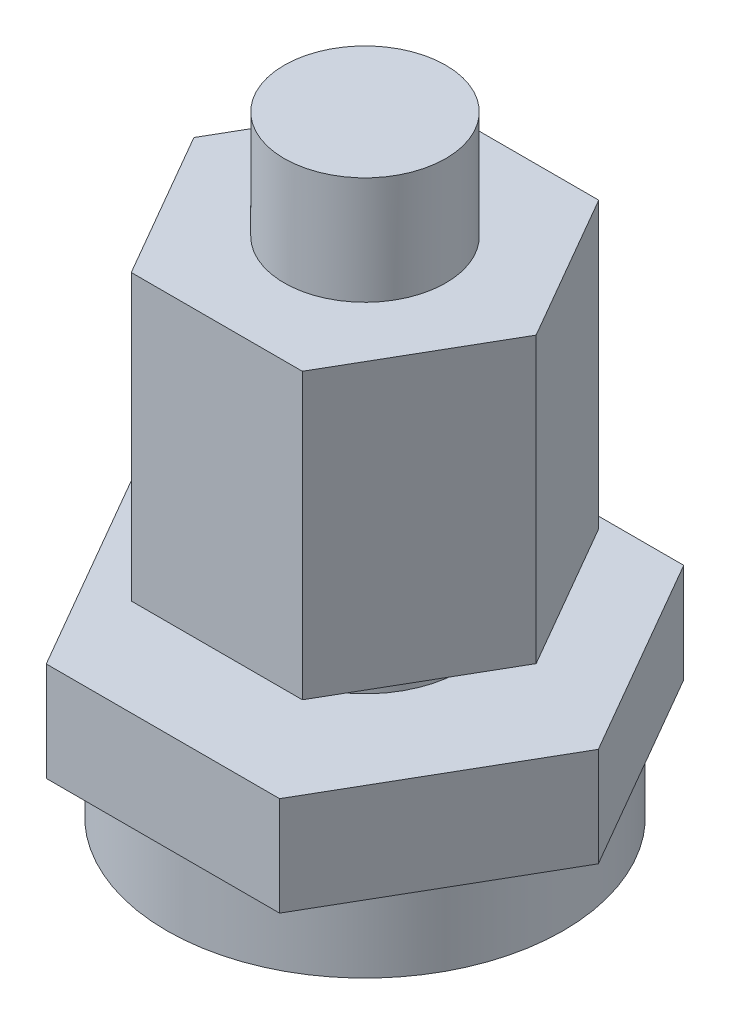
ISO-10303-21;
HEADER;
FILE_DESCRIPTION(('STEP AP214'),'2;1');
FILE_NAME('part.step','',(''),(''),'','','');
FILE_SCHEMA(('AUTOMOTIVE_DESIGN { 1 0 10303 214 1 1 1 1 }'));
ENDSEC;
DATA;
#1=APPLICATION_CONTEXT('core data for automotive mechanical design processes');
#2=APPLICATION_PROTOCOL_DEFINITION('international standard','automotive_design',2000,#1);
#3=PRODUCT_CONTEXT('',#1,'mechanical');
#4=PRODUCT('Part','Part','',(#3));
#5=PRODUCT_RELATED_PRODUCT_CATEGORY('part','',(#4));
#6=PRODUCT_DEFINITION_FORMATION('','',#4);
#7=PRODUCT_DEFINITION_CONTEXT('part definition',#1,'design');
#8=PRODUCT_DEFINITION('design','',#6,#7);
#9=PRODUCT_DEFINITION_SHAPE('','',#8);
#10=(LENGTH_UNIT() NAMED_UNIT(*) SI_UNIT(.MILLI.,.METRE.));
#11=(NAMED_UNIT(*) PLANE_ANGLE_UNIT() SI_UNIT($,.RADIAN.));
#12=(NAMED_UNIT(*) SI_UNIT($,.STERADIAN.) SOLID_ANGLE_UNIT());
#13=UNCERTAINTY_MEASURE_WITH_UNIT(LENGTH_MEASURE(1.E-05),#10,'distance_accuracy_value','');
#14=(GEOMETRIC_REPRESENTATION_CONTEXT(3) GLOBAL_UNCERTAINTY_ASSIGNED_CONTEXT((#13)) GLOBAL_UNIT_ASSIGNED_CONTEXT((#10,
#11,#12)) REPRESENTATION_CONTEXT('',''));
#15=CARTESIAN_POINT('',(0.,0.,0.));
#16=DIRECTION('',(0.,0.,1.));
#17=DIRECTION('',(1.,0.,0.));
#18=AXIS2_PLACEMENT_3D('',#15,#16,#17);
#19=CARTESIAN_POINT('',(-10.0819790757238,29.591,0.));
#20=DIRECTION('',(0.,-1.,0.));
#21=DIRECTION('',(0.,0.,-1.));
#22=AXIS2_PLACEMENT_3D('',#19,#20,#21);
#23=PLANE('',#22);
#24=DIRECTION('',(0.5,0.,0.866025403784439));
#25=VECTOR('',#24,1.);
#26=CARTESIAN_POINT('',(-10.0819790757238,29.591,0.));
#27=LINE('',#26,#25);
#28=CARTESIAN_POINT('',(-10.0819790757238,29.591,0.));
#29=VERTEX_POINT('',#28);
#30=CARTESIAN_POINT('',(-5.04098953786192,29.591,8.73125));
#31=VERTEX_POINT('',#30);
#32=EDGE_CURVE('E257',#29,#31,#27,.T.);
#33=ORIENTED_EDGE('',*,*,#32,.T.);
#34=DIRECTION('',(1.,0.,0.));
#35=VECTOR('',#34,1.);
#36=CARTESIAN_POINT('',(-5.04098953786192,29.591,8.73125));
#37=LINE('',#36,#35);
#38=CARTESIAN_POINT('',(5.04098953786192,29.591,8.73125));
#39=VERTEX_POINT('',#38);
#40=EDGE_CURVE('E285',#31,#39,#37,.T.);
#41=ORIENTED_EDGE('',*,*,#40,.T.);
#42=DIRECTION('',(0.5,0.,-0.866025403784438));
#43=VECTOR('',#42,1.);
#44=CARTESIAN_POINT('',(5.04098953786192,29.591,8.73125));
#45=LINE('',#44,#43);
#46=CARTESIAN_POINT('',(10.0819790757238,29.591,0.));
#47=VERTEX_POINT('',#46);
#48=EDGE_CURVE('E282',#39,#47,#45,.T.);
#49=ORIENTED_EDGE('',*,*,#48,.T.);
#50=DIRECTION('',(-0.500000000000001,0.,-0.866025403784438));
#51=VECTOR('',#50,1.);
#52=CARTESIAN_POINT('',(10.0819790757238,29.591,0.));
#53=LINE('',#52,#51);
#54=CARTESIAN_POINT('',(5.04098953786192,29.591,-8.73125));
#55=VERTEX_POINT('',#54);
#56=EDGE_CURVE('E279',#47,#55,#53,.T.);
#57=ORIENTED_EDGE('',*,*,#56,.T.);
#58=DIRECTION('',(-1.,0.,0.));
#59=VECTOR('',#58,1.);
#60=CARTESIAN_POINT('',(5.04098953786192,29.591,-8.73125));
#61=LINE('',#60,#59);
#62=CARTESIAN_POINT('',(-5.04098953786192,29.591,-8.73125));
#63=VERTEX_POINT('',#62);
#64=EDGE_CURVE('E276',#55,#63,#61,.T.);
#65=ORIENTED_EDGE('',*,*,#64,.T.);
#66=DIRECTION('',(-0.5,0.,0.866025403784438));
#67=VECTOR('',#66,1.);
#68=CARTESIAN_POINT('',(-5.04098953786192,29.591,-8.73125));
#69=LINE('',#68,#67);
#70=EDGE_CURVE('E253',#63,#29,#69,.T.);
#71=ORIENTED_EDGE('',*,*,#70,.T.);
#72=EDGE_LOOP('',(#33,#41,#49,#57,#65,#71));
#73=FACE_BOUND('',#72,.T.);
#74=CARTESIAN_POINT('',(0.,29.591,0.));
#75=DIRECTION('',(0.,-1.,0.));
#76=DIRECTION('',(0.,0.,-1.));
#77=AXIS2_PLACEMENT_3D('',#74,#75,#76);
#78=CIRCLE('',#77,4.7625);
#79=CARTESIAN_POINT('',(0.,29.591,-4.7625));
#80=VERTEX_POINT('',#79);
#81=EDGE_CURVE('E11',#80,#80,#78,.F.);
#82=ORIENTED_EDGE('',*,*,#81,.F.);
#83=EDGE_LOOP('',(#82));
#84=FACE_BOUND('',#83,.T.);
#85=ADVANCED_FACE('F31',(#73,#84),#23,.F.);
#86=CARTESIAN_POINT('',(-6.87407664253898,10.287,11.90625));
#87=DIRECTION('',(0.,1.,0.));
#88=DIRECTION('',(0.,0.,1.));
#89=AXIS2_PLACEMENT_3D('',#86,#87,#88);
#90=PLANE('',#89);
#91=DIRECTION('',(0.5,0.,0.866025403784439));
#92=VECTOR('',#91,1.);
#93=CARTESIAN_POINT('',(-13.748153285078,10.287,0.));
#94=LINE('',#93,#92);
#95=CARTESIAN_POINT('',(-13.748153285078,10.287,0.));
#96=VERTEX_POINT('',#95);
#97=CARTESIAN_POINT('',(-6.87407664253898,10.287,11.90625));
#98=VERTEX_POINT('',#97);
#99=EDGE_CURVE('E133',#96,#98,#94,.T.);
#100=ORIENTED_EDGE('',*,*,#99,.T.);
#101=DIRECTION('',(1.,0.,0.));
#102=VECTOR('',#101,1.);
#103=CARTESIAN_POINT('',(-6.87407664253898,10.287,11.90625));
#104=LINE('',#103,#102);
#105=CARTESIAN_POINT('',(6.87407664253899,10.287,11.90625));
#106=VERTEX_POINT('',#105);
#107=EDGE_CURVE('E87',#98,#106,#104,.T.);
#108=ORIENTED_EDGE('',*,*,#107,.T.);
#109=DIRECTION('',(0.5,0.,-0.866025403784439));
#110=VECTOR('',#109,1.);
#111=CARTESIAN_POINT('',(6.87407664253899,10.287,11.90625));
#112=LINE('',#111,#110);
#113=CARTESIAN_POINT('',(13.748153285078,10.287,0.));
#114=VERTEX_POINT('',#113);
#115=EDGE_CURVE('E104',#106,#114,#112,.T.);
#116=ORIENTED_EDGE('',*,*,#115,.T.);
#117=DIRECTION('',(-0.5,0.,-0.866025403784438));
#118=VECTOR('',#117,1.);
#119=CARTESIAN_POINT('',(13.748153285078,10.287,0.));
#120=LINE('',#119,#118);
#121=CARTESIAN_POINT('',(6.87407664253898,10.287,-11.90625));
#122=VERTEX_POINT('',#121);
#123=EDGE_CURVE('E97',#114,#122,#120,.T.);
#124=ORIENTED_EDGE('',*,*,#123,.T.);
#125=DIRECTION('',(-1.,0.,0.));
#126=VECTOR('',#125,1.);
#127=CARTESIAN_POINT('',(6.87407664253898,10.287,-11.90625));
#128=LINE('',#127,#126);
#129=CARTESIAN_POINT('',(-6.87407664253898,10.287,-11.90625));
#130=VERTEX_POINT('',#129);
#131=EDGE_CURVE('E102',#122,#130,#128,.T.);
#132=ORIENTED_EDGE('',*,*,#131,.T.);
#133=DIRECTION('',(-0.5,0.,0.866025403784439));
#134=VECTOR('',#133,1.);
#135=CARTESIAN_POINT('',(-6.87407664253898,10.287,-11.90625));
#136=LINE('',#135,#134);
#137=EDGE_CURVE('E48',#130,#96,#136,.T.);
#138=ORIENTED_EDGE('',*,*,#137,.T.);
#139=EDGE_LOOP('',(#100,#108,#116,#124,#132,#138));
#140=FACE_BOUND('',#139,.T.);
#141=CARTESIAN_POINT('',(0.,10.287,0.));
#142=DIRECTION('',(0.,1.,0.));
#143=DIRECTION('',(0.,0.,1.));
#144=AXIS2_PLACEMENT_3D('',#141,#142,#143);
#145=CIRCLE('',#144,5.715);
#146=CARTESIAN_POINT('',(0.,10.287,5.715));
#147=VERTEX_POINT('',#146);
#148=EDGE_CURVE('E230',#147,#147,#145,.T.);
#149=ORIENTED_EDGE('',*,*,#148,.F.);
#150=EDGE_LOOP('',(#149));
#151=FACE_BOUND('',#150,.T.);
#152=ADVANCED_FACE('F99',(#140,#151),#90,.T.);
#153=CARTESIAN_POINT('',(0.,4.445,0.));
#154=DIRECTION('',(0.,-1.,0.));
#155=DIRECTION('',(0.,0.,-1.));
#156=AXIS2_PLACEMENT_3D('',#153,#154,#155);
#157=CYLINDRICAL_SURFACE('',#156,11.684);
#158=CARTESIAN_POINT('',(0.,4.445,0.));
#159=DIRECTION('',(0.,1.,0.));
#160=DIRECTION('',(0.,0.,1.));
#161=AXIS2_PLACEMENT_3D('',#158,#159,#160);
#162=CIRCLE('',#161,11.684);
#163=CARTESIAN_POINT('',(0.,4.445,11.684));
#164=VERTEX_POINT('',#163);
#165=EDGE_CURVE('E40',#164,#164,#162,.T.);
#166=ORIENTED_EDGE('',*,*,#165,.F.);
#167=EDGE_LOOP('',(#166));
#168=FACE_BOUND('',#167,.T.);
#169=CARTESIAN_POINT('',(0.,0.,0.));
#170=DIRECTION('',(0.,1.,0.));
#171=DIRECTION('',(0.,0.,1.));
#172=AXIS2_PLACEMENT_3D('',#169,#170,#171);
#173=CIRCLE('',#172,11.684);
#174=CARTESIAN_POINT('',(0.,0.,11.684));
#175=VERTEX_POINT('',#174);
#176=EDGE_CURVE('E142',#175,#175,#173,.T.);
#177=ORIENTED_EDGE('',*,*,#176,.T.);
#178=EDGE_LOOP('',(#177));
#179=FACE_BOUND('',#178,.T.);
#180=ADVANCED_FACE('F33',(#168,#179),#157,.T.);
#181=CARTESIAN_POINT('',(0.,0.,0.));
#182=DIRECTION('',(0.,1.,0.));
#183=DIRECTION('',(0.,0.,1.));
#184=AXIS2_PLACEMENT_3D('',#181,#182,#183);
#185=PLANE('',#184);
#186=ORIENTED_EDGE('',*,*,#176,.F.);
#187=EDGE_LOOP('',(#186));
#188=FACE_BOUND('',#187,.T.);
#189=ADVANCED_FACE('F148',(#188),#185,.F.);
#190=CARTESIAN_POINT('',(-6.87407664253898,4.445,11.90625));
#191=DIRECTION('',(0.,1.,0.));
#192=DIRECTION('',(0.,0.,1.));
#193=AXIS2_PLACEMENT_3D('',#190,#191,#192);
#194=PLANE('',#193);
#195=DIRECTION('',(0.5,0.,0.866025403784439));
#196=VECTOR('',#195,1.);
#197=CARTESIAN_POINT('',(-13.748153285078,4.445,0.));
#198=LINE('',#197,#196);
#199=CARTESIAN_POINT('',(-13.748153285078,4.445,0.));
#200=VERTEX_POINT('',#199);
#201=CARTESIAN_POINT('',(-6.87407664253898,4.445,11.90625));
#202=VERTEX_POINT('',#201);
#203=EDGE_CURVE('E122',#200,#202,#198,.T.);
#204=ORIENTED_EDGE('',*,*,#203,.F.);
#205=DIRECTION('',(-0.5,0.,0.866025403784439));
#206=VECTOR('',#205,1.);
#207=CARTESIAN_POINT('',(-6.87407664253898,4.445,-11.90625));
#208=LINE('',#207,#206);
#209=CARTESIAN_POINT('',(-6.87407664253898,4.445,-11.90625));
#210=VERTEX_POINT('',#209);
#211=EDGE_CURVE('E78',#210,#200,#208,.T.);
#212=ORIENTED_EDGE('',*,*,#211,.F.);
#213=DIRECTION('',(-1.,0.,0.));
#214=VECTOR('',#213,1.);
#215=CARTESIAN_POINT('',(6.87407664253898,4.445,-11.90625));
#216=LINE('',#215,#214);
#217=CARTESIAN_POINT('',(6.87407664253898,4.445,-11.90625));
#218=VERTEX_POINT('',#217);
#219=EDGE_CURVE('E72',#218,#210,#216,.T.);
#220=ORIENTED_EDGE('',*,*,#219,.F.);
#221=DIRECTION('',(-0.5,0.,-0.866025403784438));
#222=VECTOR('',#221,1.);
#223=CARTESIAN_POINT('',(13.748153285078,4.445,0.));
#224=LINE('',#223,#222);
#225=CARTESIAN_POINT('',(13.748153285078,4.445,0.));
#226=VERTEX_POINT('',#225);
#227=EDGE_CURVE('E112',#226,#218,#224,.T.);
#228=ORIENTED_EDGE('',*,*,#227,.F.);
#229=DIRECTION('',(0.5,0.,-0.866025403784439));
#230=VECTOR('',#229,1.);
#231=CARTESIAN_POINT('',(6.87407664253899,4.445,11.90625));
#232=LINE('',#231,#230);
#233=CARTESIAN_POINT('',(6.87407664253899,4.445,11.90625));
#234=VERTEX_POINT('',#233);
#235=EDGE_CURVE('E128',#234,#226,#232,.T.);
#236=ORIENTED_EDGE('',*,*,#235,.F.);
#237=DIRECTION('',(1.,0.,0.));
#238=VECTOR('',#237,1.);
#239=CARTESIAN_POINT('',(-6.87407664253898,4.445,11.90625));
#240=LINE('',#239,#238);
#241=EDGE_CURVE('E125',#202,#234,#240,.T.);
#242=ORIENTED_EDGE('',*,*,#241,.F.);
#243=EDGE_LOOP('',(#204,#212,#220,#228,#236,#242));
#244=FACE_BOUND('',#243,.T.);
#245=ORIENTED_EDGE('',*,*,#165,.T.);
#246=EDGE_LOOP('',(#245));
#247=FACE_BOUND('',#246,.T.);
#248=ADVANCED_FACE('F150',(#244,#247),#194,.F.);
#249=CARTESIAN_POINT('',(-13.748153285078,10.287,0.));
#250=DIRECTION('',(0.866025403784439,0.,-0.5));
#251=DIRECTION('',(-0.5,0.,-0.866025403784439));
#252=AXIS2_PLACEMENT_3D('',#249,#250,#251);
#253=PLANE('',#252);
#254=ORIENTED_EDGE('',*,*,#203,.T.);
#255=DIRECTION('',(0.,-1.,0.));
#256=VECTOR('',#255,1.);
#257=CARTESIAN_POINT('',(-6.87407664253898,10.287,11.90625));
#258=LINE('',#257,#256);
#259=EDGE_CURVE('E140',#98,#202,#258,.T.);
#260=ORIENTED_EDGE('',*,*,#259,.F.);
#261=ORIENTED_EDGE('',*,*,#99,.F.);
#262=DIRECTION('',(0.,-1.,0.));
#263=VECTOR('',#262,1.);
#264=CARTESIAN_POINT('',(-13.748153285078,10.287,0.));
#265=LINE('',#264,#263);
#266=EDGE_CURVE('E118',#96,#200,#265,.T.);
#267=ORIENTED_EDGE('',*,*,#266,.T.);
#268=EDGE_LOOP('',(#254,#260,#261,#267));
#269=FACE_BOUND('',#268,.T.);
#270=ADVANCED_FACE('F155',(#269),#253,.F.);
#271=CARTESIAN_POINT('',(-6.87407664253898,10.287,11.90625));
#272=DIRECTION('',(0.,0.,-1.));
#273=DIRECTION('',(-1.,0.,0.));
#274=AXIS2_PLACEMENT_3D('',#271,#272,#273);
#275=PLANE('',#274);
#276=ORIENTED_EDGE('',*,*,#241,.T.);
#277=DIRECTION('',(0.,-1.,0.));
#278=VECTOR('',#277,1.);
#279=CARTESIAN_POINT('',(6.87407664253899,10.287,11.90625));
#280=LINE('',#279,#278);
#281=EDGE_CURVE('E137',#106,#234,#280,.T.);
#282=ORIENTED_EDGE('',*,*,#281,.F.);
#283=ORIENTED_EDGE('',*,*,#107,.F.);
#284=ORIENTED_EDGE('',*,*,#259,.T.);
#285=EDGE_LOOP('',(#276,#282,#283,#284));
#286=FACE_BOUND('',#285,.T.);
#287=ADVANCED_FACE('F215',(#286),#275,.F.);
#288=CARTESIAN_POINT('',(6.87407664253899,10.287,11.90625));
#289=DIRECTION('',(-0.866025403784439,0.,-0.5));
#290=DIRECTION('',(-0.5,0.,0.866025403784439));
#291=AXIS2_PLACEMENT_3D('',#288,#289,#290);
#292=PLANE('',#291);
#293=ORIENTED_EDGE('',*,*,#235,.T.);
#294=DIRECTION('',(0.,-1.,0.));
#295=VECTOR('',#294,1.);
#296=CARTESIAN_POINT('',(13.748153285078,10.287,0.));
#297=LINE('',#296,#295);
#298=EDGE_CURVE('E113',#114,#226,#297,.T.);
#299=ORIENTED_EDGE('',*,*,#298,.F.);
#300=ORIENTED_EDGE('',*,*,#115,.F.);
#301=ORIENTED_EDGE('',*,*,#281,.T.);
#302=EDGE_LOOP('',(#293,#299,#300,#301));
#303=FACE_BOUND('',#302,.T.);
#304=ADVANCED_FACE('F212',(#303),#292,.F.);
#305=CARTESIAN_POINT('',(13.748153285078,10.287,0.));
#306=DIRECTION('',(-0.866025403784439,0.,0.5));
#307=DIRECTION('',(0.5,0.,0.866025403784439));
#308=AXIS2_PLACEMENT_3D('',#305,#306,#307);
#309=PLANE('',#308);
#310=ORIENTED_EDGE('',*,*,#227,.T.);
#311=DIRECTION('',(0.,-1.,0.));
#312=VECTOR('',#311,1.);
#313=CARTESIAN_POINT('',(6.87407664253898,10.287,-11.90625));
#314=LINE('',#313,#312);
#315=EDGE_CURVE('E109',#122,#218,#314,.T.);
#316=ORIENTED_EDGE('',*,*,#315,.F.);
#317=ORIENTED_EDGE('',*,*,#123,.F.);
#318=ORIENTED_EDGE('',*,*,#298,.T.);
#319=EDGE_LOOP('',(#310,#316,#317,#318));
#320=FACE_BOUND('',#319,.T.);
#321=ADVANCED_FACE('F110',(#320),#309,.F.);
#322=CARTESIAN_POINT('',(6.87407664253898,10.287,-11.90625));
#323=DIRECTION('',(0.,0.,1.));
#324=DIRECTION('',(1.,0.,0.));
#325=AXIS2_PLACEMENT_3D('',#322,#323,#324);
#326=PLANE('',#325);
#327=ORIENTED_EDGE('',*,*,#219,.T.);
#328=DIRECTION('',(0.,-1.,0.));
#329=VECTOR('',#328,1.);
#330=CARTESIAN_POINT('',(-6.87407664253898,10.287,-11.90625));
#331=LINE('',#330,#329);
#332=EDGE_CURVE('E114',#130,#210,#331,.T.);
#333=ORIENTED_EDGE('',*,*,#332,.F.);
#334=ORIENTED_EDGE('',*,*,#131,.F.);
#335=ORIENTED_EDGE('',*,*,#315,.T.);
#336=EDGE_LOOP('',(#327,#333,#334,#335));
#337=FACE_BOUND('',#336,.T.);
#338=ADVANCED_FACE('F116',(#337),#326,.F.);
#339=CARTESIAN_POINT('',(-6.87407664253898,10.287,-11.90625));
#340=DIRECTION('',(0.866025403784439,0.,0.5));
#341=DIRECTION('',(0.5,0.,-0.866025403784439));
#342=AXIS2_PLACEMENT_3D('',#339,#340,#341);
#343=PLANE('',#342);
#344=ORIENTED_EDGE('',*,*,#211,.T.);
#345=ORIENTED_EDGE('',*,*,#266,.F.);
#346=ORIENTED_EDGE('',*,*,#137,.F.);
#347=ORIENTED_EDGE('',*,*,#332,.T.);
#348=EDGE_LOOP('',(#344,#345,#346,#347));
#349=FACE_BOUND('',#348,.T.);
#350=ADVANCED_FACE('F203',(#349),#343,.F.);
#351=CARTESIAN_POINT('',(0.,12.827,0.));
#352=DIRECTION('',(0.,-1.,0.));
#353=DIRECTION('',(0.,0.,-1.));
#354=AXIS2_PLACEMENT_3D('',#351,#352,#353);
#355=CYLINDRICAL_SURFACE('',#354,5.715);
#356=CARTESIAN_POINT('',(0.,12.827,0.));
#357=DIRECTION('',(0.,1.,0.));
#358=DIRECTION('',(0.,0.,1.));
#359=AXIS2_PLACEMENT_3D('',#356,#357,#358);
#360=CIRCLE('',#359,5.715);
#361=CARTESIAN_POINT('',(0.,12.827,5.715));
#362=VERTEX_POINT('',#361);
#363=EDGE_CURVE('E126',#362,#362,#360,.T.);
#364=ORIENTED_EDGE('',*,*,#363,.F.);
#365=EDGE_LOOP('',(#364));
#366=FACE_BOUND('',#365,.T.);
#367=ORIENTED_EDGE('',*,*,#148,.T.);
#368=EDGE_LOOP('',(#367));
#369=FACE_BOUND('',#368,.T.);
#370=ADVANCED_FACE('F177',(#366,#369),#355,.T.);
#371=CARTESIAN_POINT('',(-10.0819790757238,12.827,0.));
#372=DIRECTION('',(0.,-1.,0.));
#373=DIRECTION('',(0.,0.,-1.));
#374=AXIS2_PLACEMENT_3D('',#371,#372,#373);
#375=PLANE('',#374);
#376=DIRECTION('',(0.5,0.,0.866025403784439));
#377=VECTOR('',#376,1.);
#378=CARTESIAN_POINT('',(-10.0819790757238,12.827,0.));
#379=LINE('',#378,#377);
#380=CARTESIAN_POINT('',(-10.0819790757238,12.827,0.));
#381=VERTEX_POINT('',#380);
#382=CARTESIAN_POINT('',(-5.04098953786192,12.827,8.73125));
#383=VERTEX_POINT('',#382);
#384=EDGE_CURVE('E270',#381,#383,#379,.T.);
#385=ORIENTED_EDGE('',*,*,#384,.F.);
#386=DIRECTION('',(-0.5,0.,0.866025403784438));
#387=VECTOR('',#386,1.);
#388=CARTESIAN_POINT('',(-5.04098953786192,12.827,-8.73125));
#389=LINE('',#388,#387);
#390=CARTESIAN_POINT('',(-5.04098953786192,12.827,-8.73125));
#391=VERTEX_POINT('',#390);
#392=EDGE_CURVE('E254',#391,#381,#389,.T.);
#393=ORIENTED_EDGE('',*,*,#392,.F.);
#394=DIRECTION('',(-1.,0.,0.));
#395=VECTOR('',#394,1.);
#396=CARTESIAN_POINT('',(5.04098953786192,12.827,-8.73125));
#397=LINE('',#396,#395);
#398=CARTESIAN_POINT('',(5.04098953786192,12.827,-8.73125));
#399=VERTEX_POINT('',#398);
#400=EDGE_CURVE('E258',#399,#391,#397,.T.);
#401=ORIENTED_EDGE('',*,*,#400,.F.);
#402=DIRECTION('',(-0.500000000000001,0.,-0.866025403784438));
#403=VECTOR('',#402,1.);
#404=CARTESIAN_POINT('',(10.0819790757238,12.827,0.));
#405=LINE('',#404,#403);
#406=CARTESIAN_POINT('',(10.0819790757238,12.827,0.));
#407=VERTEX_POINT('',#406);
#408=EDGE_CURVE('E261',#407,#399,#405,.T.);
#409=ORIENTED_EDGE('',*,*,#408,.F.);
#410=DIRECTION('',(0.5,0.,-0.866025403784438));
#411=VECTOR('',#410,1.);
#412=CARTESIAN_POINT('',(5.04098953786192,12.827,8.73125));
#413=LINE('',#412,#411);
#414=CARTESIAN_POINT('',(5.04098953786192,12.827,8.73125));
#415=VERTEX_POINT('',#414);
#416=EDGE_CURVE('E264',#415,#407,#413,.T.);
#417=ORIENTED_EDGE('',*,*,#416,.F.);
#418=DIRECTION('',(1.,0.,0.));
#419=VECTOR('',#418,1.);
#420=CARTESIAN_POINT('',(-5.04098953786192,12.827,8.73125));
#421=LINE('',#420,#419);
#422=EDGE_CURVE('E267',#383,#415,#421,.T.);
#423=ORIENTED_EDGE('',*,*,#422,.F.);
#424=EDGE_LOOP('',(#385,#393,#401,#409,#417,#423));
#425=FACE_BOUND('',#424,.T.);
#426=ORIENTED_EDGE('',*,*,#363,.T.);
#427=EDGE_LOOP('',(#426));
#428=FACE_BOUND('',#427,.T.);
#429=ADVANCED_FACE('F173',(#425,#428),#375,.T.);
#430=CARTESIAN_POINT('',(-10.0819790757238,29.591,0.));
#431=DIRECTION('',(0.866025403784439,0.,-0.5));
#432=DIRECTION('',(-0.5,0.,-0.866025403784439));
#433=AXIS2_PLACEMENT_3D('',#430,#431,#432);
#434=PLANE('',#433);
#435=ORIENTED_EDGE('',*,*,#384,.T.);
#436=DIRECTION('',(0.,-1.,0.));
#437=VECTOR('',#436,1.);
#438=CARTESIAN_POINT('',(-5.04098953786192,29.591,8.73125));
#439=LINE('',#438,#437);
#440=EDGE_CURVE('E233',#31,#383,#439,.T.);
#441=ORIENTED_EDGE('',*,*,#440,.F.);
#442=ORIENTED_EDGE('',*,*,#32,.F.);
#443=DIRECTION('',(0.,-1.,0.));
#444=VECTOR('',#443,1.);
#445=CARTESIAN_POINT('',(-10.0819790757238,29.591,0.));
#446=LINE('',#445,#444);
#447=EDGE_CURVE('E250',#29,#381,#446,.T.);
#448=ORIENTED_EDGE('',*,*,#447,.T.);
#449=EDGE_LOOP('',(#435,#441,#442,#448));
#450=FACE_BOUND('',#449,.T.);
#451=ADVANCED_FACE('F176',(#450),#434,.F.);
#452=CARTESIAN_POINT('',(-5.04098953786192,29.591,8.73125));
#453=DIRECTION('',(0.,0.,-1.));
#454=DIRECTION('',(-1.,0.,0.));
#455=AXIS2_PLACEMENT_3D('',#452,#453,#454);
#456=PLANE('',#455);
#457=ORIENTED_EDGE('',*,*,#422,.T.);
#458=DIRECTION('',(0.,-1.,0.));
#459=VECTOR('',#458,1.);
#460=CARTESIAN_POINT('',(5.04098953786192,29.591,8.73125));
#461=LINE('',#460,#459);
#462=EDGE_CURVE('E238',#39,#415,#461,.T.);
#463=ORIENTED_EDGE('',*,*,#462,.F.);
#464=ORIENTED_EDGE('',*,*,#40,.F.);
#465=ORIENTED_EDGE('',*,*,#440,.T.);
#466=EDGE_LOOP('',(#457,#463,#464,#465));
#467=FACE_BOUND('',#466,.T.);
#468=ADVANCED_FACE('F194',(#467),#456,.F.);
#469=CARTESIAN_POINT('',(5.04098953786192,29.591,8.73125));
#470=DIRECTION('',(-0.866025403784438,0.,-0.5));
#471=DIRECTION('',(-0.5,0.,0.866025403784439));
#472=AXIS2_PLACEMENT_3D('',#469,#470,#471);
#473=PLANE('',#472);
#474=ORIENTED_EDGE('',*,*,#416,.T.);
#475=DIRECTION('',(0.,-1.,0.));
#476=VECTOR('',#475,1.);
#477=CARTESIAN_POINT('',(10.0819790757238,29.591,0.));
#478=LINE('',#477,#476);
#479=EDGE_CURVE('E241',#47,#407,#478,.T.);
#480=ORIENTED_EDGE('',*,*,#479,.F.);
#481=ORIENTED_EDGE('',*,*,#48,.F.);
#482=ORIENTED_EDGE('',*,*,#462,.T.);
#483=EDGE_LOOP('',(#474,#480,#481,#482));
#484=FACE_BOUND('',#483,.T.);
#485=ADVANCED_FACE('F190',(#484),#473,.F.);
#486=CARTESIAN_POINT('',(10.0819790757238,29.591,0.));
#487=DIRECTION('',(-0.866025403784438,0.,0.500000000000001));
#488=DIRECTION('',(0.500000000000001,0.,0.866025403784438));
#489=AXIS2_PLACEMENT_3D('',#486,#487,#488);
#490=PLANE('',#489);
#491=ORIENTED_EDGE('',*,*,#408,.T.);
#492=DIRECTION('',(0.,-1.,0.));
#493=VECTOR('',#492,1.);
#494=CARTESIAN_POINT('',(5.04098953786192,29.591,-8.73125));
#495=LINE('',#494,#493);
#496=EDGE_CURVE('E244',#55,#399,#495,.T.);
#497=ORIENTED_EDGE('',*,*,#496,.F.);
#498=ORIENTED_EDGE('',*,*,#56,.F.);
#499=ORIENTED_EDGE('',*,*,#479,.T.);
#500=EDGE_LOOP('',(#491,#497,#498,#499));
#501=FACE_BOUND('',#500,.T.);
#502=ADVANCED_FACE('F186',(#501),#490,.F.);
#503=CARTESIAN_POINT('',(5.04098953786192,29.591,-8.73125));
#504=DIRECTION('',(0.,0.,1.));
#505=DIRECTION('',(1.,0.,0.));
#506=AXIS2_PLACEMENT_3D('',#503,#504,#505);
#507=PLANE('',#506);
#508=ORIENTED_EDGE('',*,*,#400,.T.);
#509=DIRECTION('',(0.,-1.,0.));
#510=VECTOR('',#509,1.);
#511=CARTESIAN_POINT('',(-5.04098953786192,29.591,-8.73125));
#512=LINE('',#511,#510);
#513=EDGE_CURVE('E247',#63,#391,#512,.T.);
#514=ORIENTED_EDGE('',*,*,#513,.F.);
#515=ORIENTED_EDGE('',*,*,#64,.F.);
#516=ORIENTED_EDGE('',*,*,#496,.T.);
#517=EDGE_LOOP('',(#508,#514,#515,#516));
#518=FACE_BOUND('',#517,.T.);
#519=ADVANCED_FACE('F182',(#518),#507,.F.);
#520=CARTESIAN_POINT('',(-5.04098953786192,29.591,-8.73125));
#521=DIRECTION('',(0.866025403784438,0.,0.5));
#522=DIRECTION('',(0.5,0.,-0.866025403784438));
#523=AXIS2_PLACEMENT_3D('',#520,#521,#522);
#524=PLANE('',#523);
#525=ORIENTED_EDGE('',*,*,#392,.T.);
#526=ORIENTED_EDGE('',*,*,#447,.F.);
#527=ORIENTED_EDGE('',*,*,#70,.F.);
#528=ORIENTED_EDGE('',*,*,#513,.T.);
#529=EDGE_LOOP('',(#525,#526,#527,#528));
#530=FACE_BOUND('',#529,.T.);
#531=ADVANCED_FACE('F179',(#530),#524,.F.);
#532=CARTESIAN_POINT('',(0.,35.941,0.));
#533=DIRECTION('',(0.,-1.,0.));
#534=DIRECTION('',(0.,0.,-1.));
#535=AXIS2_PLACEMENT_3D('',#532,#533,#534);
#536=CYLINDRICAL_SURFACE('',#535,4.7625);
#537=CARTESIAN_POINT('',(0.,35.941,0.));
#538=DIRECTION('',(0.,1.,0.));
#539=DIRECTION('',(0.,0.,1.));
#540=AXIS2_PLACEMENT_3D('',#537,#538,#539);
#541=CIRCLE('',#540,4.7625);
#542=CARTESIAN_POINT('',(0.,35.941,4.7625));
#543=VERTEX_POINT('',#542);
#544=EDGE_CURVE('E273',#543,#543,#541,.T.);
#545=ORIENTED_EDGE('',*,*,#544,.F.);
#546=EDGE_LOOP('',(#545));
#547=FACE_BOUND('',#546,.T.);
#548=ORIENTED_EDGE('',*,*,#81,.T.);
#549=EDGE_LOOP('',(#548));
#550=FACE_BOUND('',#549,.T.);
#551=ADVANCED_FACE('F171',(#547,#550),#536,.T.);
#552=CARTESIAN_POINT('',(0.,35.941,0.));
#553=DIRECTION('',(0.,1.,0.));
#554=DIRECTION('',(0.,0.,1.));
#555=AXIS2_PLACEMENT_3D('',#552,#553,#554);
#556=PLANE('',#555);
#557=ORIENTED_EDGE('',*,*,#544,.T.);
#558=EDGE_LOOP('',(#557));
#559=FACE_BOUND('',#558,.T.);
#560=ADVANCED_FACE('F292',(#559),#556,.T.);
#561=CLOSED_SHELL('',(#85,#152,#180,#189,#248,#270,#287,#304,#321,#338,#350,#370,#429,#451,#468,
#485,#502,#519,#531,#551,#560));
#562=MANIFOLD_SOLID_BREP('B2',#561);
#563=ADVANCED_BREP_SHAPE_REPRESENTATION('',(#18,#562),#14);
#564=SHAPE_DEFINITION_REPRESENTATION(#9,#563);
ENDSEC;
END-ISO-10303-21;
